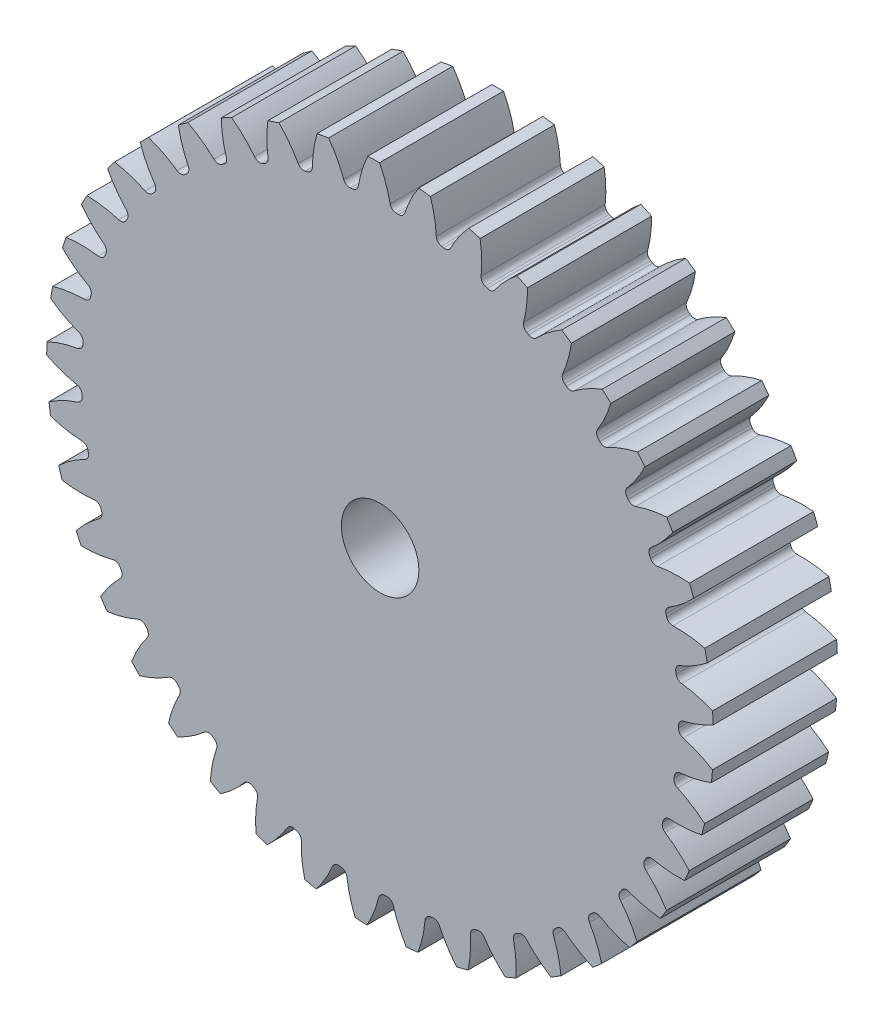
from build123d import *

# Parameters (mm, degrees)
SKETCH3_R         = 273.05
GEARBODY_DEPTH    = 101.6
TOOTHCUT_DEPTH    = 400.293332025
CIRPATTERN1_COUNT = 41
BOREDIA_R         = 31.75
BORE_DEPTH        = 12700


with BuildPart() as part:
    # Sketch3 → gearBody (new body)
    with BuildSketch(Plane.XY):
        Circle(SKETCH3_R)
    extrude(amount=GEARBODY_DEPTH)

    # Sketch2 → toothCut (cut, through all)
    with BuildSketch(Plane.XY):
        with BuildLine():
            ThreePointArc((244.411642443, -5.565488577), (244.431701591, -4.600965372), (244.447954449, -3.636370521))
            ThreePointArc((244.447954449, -3.636370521), (245.57749572, -0.487462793), (248.398810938, 1.310220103))
            ThreePointArc((248.398810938, 1.310220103), (261.067585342, 5.337753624), (273.05, 11.094541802))
            ThreePointArc((273.05, 11.094541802), (273.226904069, -5.142980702), (272.4390604, -21.362343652))
            ThreePointArc((272.4390604, -21.362343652), (260.681778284, -15.158700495), (248.173545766, -10.657257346))
            ThreePointArc((248.173545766, -10.657257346), (245.421881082, -8.754673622), (244.411642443, -5.565488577))
        make_face()
    toothcut = extrude(amount=TOOTHCUT_DEPTH, mode=Mode.SUBTRACT)

    # CirPattern1: toothCut ×41 about axis
    cirpattern1_axis = Axis((0, 0, 0), (0, 0, 1))
    for i in range(1, CIRPATTERN1_COUNT):
        add(toothcut.rotate(cirpattern1_axis, i * 360 / CIRPATTERN1_COUNT), mode=Mode.SUBTRACT)

    # boreDia → bore (cut, symmetric)
    with BuildSketch(Plane.XY):
        Circle(BOREDIA_R)
    extrude(amount=BORE_DEPTH, both=True, mode=Mode.SUBTRACT)


solid = part.part
